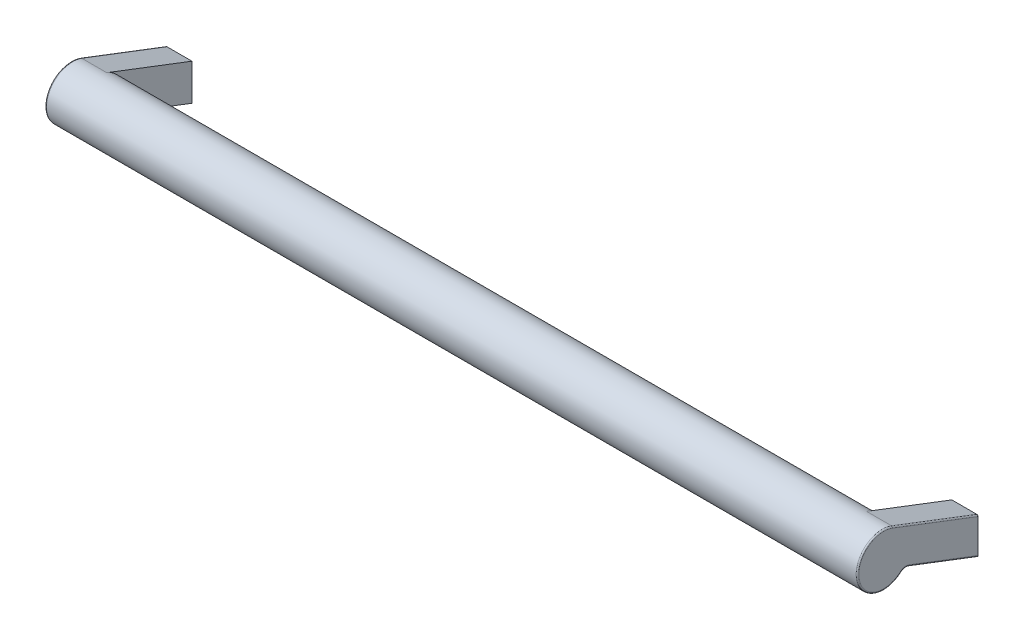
ISO-10303-21;
HEADER;
FILE_DESCRIPTION(('STEP AP214'),'2;1');
FILE_NAME('part.step','',(''),(''),'','','');
FILE_SCHEMA(('AUTOMOTIVE_DESIGN { 1 0 10303 214 1 1 1 1 }'));
ENDSEC;
DATA;
#1=APPLICATION_CONTEXT('core data for automotive mechanical design processes');
#2=APPLICATION_PROTOCOL_DEFINITION('international standard','automotive_design',2000,#1);
#3=PRODUCT_CONTEXT('',#1,'mechanical');
#4=PRODUCT('Part','Part','',(#3));
#5=PRODUCT_RELATED_PRODUCT_CATEGORY('part','',(#4));
#6=PRODUCT_DEFINITION_FORMATION('','',#4);
#7=PRODUCT_DEFINITION_CONTEXT('part definition',#1,'design');
#8=PRODUCT_DEFINITION('design','',#6,#7);
#9=PRODUCT_DEFINITION_SHAPE('','',#8);
#10=(LENGTH_UNIT() NAMED_UNIT(*) SI_UNIT(.MILLI.,.METRE.));
#11=(NAMED_UNIT(*) PLANE_ANGLE_UNIT() SI_UNIT($,.RADIAN.));
#12=(NAMED_UNIT(*) SI_UNIT($,.STERADIAN.) SOLID_ANGLE_UNIT());
#13=UNCERTAINTY_MEASURE_WITH_UNIT(LENGTH_MEASURE(1.E-05),#10,'distance_accuracy_value','');
#14=(GEOMETRIC_REPRESENTATION_CONTEXT(3) GLOBAL_UNCERTAINTY_ASSIGNED_CONTEXT((#13)) GLOBAL_UNIT_ASSIGNED_CONTEXT((#10,
#11,#12)) REPRESENTATION_CONTEXT('',''));
#15=CARTESIAN_POINT('',(0.,0.,0.));
#16=DIRECTION('',(0.,0.,1.));
#17=DIRECTION('',(1.,0.,0.));
#18=AXIS2_PLACEMENT_3D('',#15,#16,#17);
#19=CARTESIAN_POINT('',(145.,10.,36.));
#20=DIRECTION('',(1.,0.,0.));
#21=DIRECTION('',(0.,1.,0.));
#22=AXIS2_PLACEMENT_3D('',#19,#20,#21);
#23=CYLINDRICAL_SURFACE('',#22,10.);
#24=CARTESIAN_POINT('',(5.,10.,36.));
#25=DIRECTION('',(1.,0.,0.));
#26=DIRECTION('',(0.,1.,0.));
#27=AXIS2_PLACEMENT_3D('',#24,#25,#26);
#28=CIRCLE('',#27,10.);
#29=CARTESIAN_POINT('',(5.,2.30325569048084,29.6156341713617));
#30=VERTEX_POINT('',#29);
#31=CARTESIAN_POINT('',(5.,2.72629051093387,29.137555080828));
#32=VERTEX_POINT('',#31);
#33=EDGE_CURVE('E311',#30,#32,#28,.T.);
#34=ORIENTED_EDGE('',*,*,#33,.T.);
#35=CARTESIAN_POINT('',(5.,19.2986703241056,32.3210422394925));
#36=VERTEX_POINT('',#35);
#37=EDGE_CURVE('E38',#32,#36,#28,.T.);
#38=ORIENTED_EDGE('',*,*,#37,.T.);
#39=CARTESIAN_POINT('',(4.99999999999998,10.,36.));
#40=DIRECTION('',(1.,0.,0.));
#41=DIRECTION('',(0.,0.92986703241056,-0.367895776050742));
#42=AXIS2_PLACEMENT_3D('',#39,#40,#41);
#43=CIRCLE('',#42,10.);
#44=CARTESIAN_POINT('',(5.,19.3773951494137,32.5266068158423));
#45=VERTEX_POINT('',#44);
#46=EDGE_CURVE('E24',#36,#45,#43,.T.);
#47=ORIENTED_EDGE('',*,*,#46,.T.);
#48=DIRECTION('',(1.,0.,0.));
#49=VECTOR('',#48,1.);
#50=CARTESIAN_POINT('',(-5.,19.3773951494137,32.5266068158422));
#51=LINE('',#50,#49);
#52=CARTESIAN_POINT('',(-4.5,19.3773951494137,32.5266068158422));
#53=VERTEX_POINT('',#52);
#54=EDGE_CURVE('E463',#45,#53,#51,.F.);
#55=ORIENTED_EDGE('',*,*,#54,.T.);
#56=CARTESIAN_POINT('',(-4.5,10.,36.));
#57=DIRECTION('',(1.,0.,0.));
#58=DIRECTION('',(0.,1.,0.));
#59=AXIS2_PLACEMENT_3D('',#56,#57,#58);
#60=CIRCLE('',#59,10.);
#61=CARTESIAN_POINT('',(-4.5,2.30325569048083,29.6156341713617));
#62=VERTEX_POINT('',#61);
#63=EDGE_CURVE('E393',#62,#53,#60,.F.);
#64=ORIENTED_EDGE('',*,*,#63,.F.);
#65=DIRECTION('',(1.,0.,0.));
#66=VECTOR('',#65,1.);
#67=CARTESIAN_POINT('',(-5.,2.30325569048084,29.6156341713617));
#68=LINE('',#67,#66);
#69=EDGE_CURVE('E454',#62,#30,#68,.T.);
#70=ORIENTED_EDGE('',*,*,#69,.T.);
#71=EDGE_LOOP('',(#34,#38,#47,#55,#64,#70));
#72=FACE_BOUND('',#71,.T.);
#73=DIRECTION('',(1.,0.,0.));
#74=VECTOR('',#73,1.);
#75=CARTESIAN_POINT('',(295.,2.30325569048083,29.6156341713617));
#76=LINE('',#75,#74);
#77=CARTESIAN_POINT('',(295.,2.30325569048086,29.6156341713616));
#78=VERTEX_POINT('',#77);
#79=CARTESIAN_POINT('',(304.5,2.30325569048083,29.6156341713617));
#80=VERTEX_POINT('',#79);
#81=EDGE_CURVE('E198',#78,#80,#76,.T.);
#82=ORIENTED_EDGE('',*,*,#81,.T.);
#83=CARTESIAN_POINT('',(304.5,10.,36.));
#84=DIRECTION('',(1.,0.,0.));
#85=DIRECTION('',(0.,1.,0.));
#86=AXIS2_PLACEMENT_3D('',#83,#84,#85);
#87=CIRCLE('',#86,10.);
#88=CARTESIAN_POINT('',(304.5,19.3773951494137,32.5266068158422));
#89=VERTEX_POINT('',#88);
#90=EDGE_CURVE('E594',#89,#80,#87,.T.);
#91=ORIENTED_EDGE('',*,*,#90,.F.);
#92=DIRECTION('',(1.,0.,0.));
#93=VECTOR('',#92,1.);
#94=CARTESIAN_POINT('',(295.,19.3773951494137,32.5266068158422));
#95=LINE('',#94,#93);
#96=CARTESIAN_POINT('',(295.,19.3773951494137,32.5266068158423));
#97=VERTEX_POINT('',#96);
#98=EDGE_CURVE('E160',#89,#97,#95,.F.);
#99=ORIENTED_EDGE('',*,*,#98,.T.);
#100=CARTESIAN_POINT('',(295.,10.,36.));
#101=DIRECTION('',(-1.,0.,0.));
#102=DIRECTION('',(0.,0.937739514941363,-0.347339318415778));
#103=AXIS2_PLACEMENT_3D('',#100,#101,#102);
#104=CIRCLE('',#103,10.);
#105=CARTESIAN_POINT('',(295.,19.2986703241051,32.3210422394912));
#106=VERTEX_POINT('',#105);
#107=EDGE_CURVE('E154',#97,#106,#104,.T.);
#108=ORIENTED_EDGE('',*,*,#107,.T.);
#109=CARTESIAN_POINT('',(295.,10.,36.));
#110=DIRECTION('',(1.,0.,0.));
#111=DIRECTION('',(0.,1.,0.));
#112=AXIS2_PLACEMENT_3D('',#109,#110,#111);
#113=CIRCLE('',#112,10.);
#114=CARTESIAN_POINT('',(295.,2.72629051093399,29.1375550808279));
#115=VERTEX_POINT('',#114);
#116=EDGE_CURVE('E157',#115,#106,#113,.T.);
#117=ORIENTED_EDGE('',*,*,#116,.F.);
#118=CARTESIAN_POINT('',(295.,10.,36.));
#119=DIRECTION('',(1.,0.,0.));
#120=DIRECTION('',(0.,1.,0.));
#121=AXIS2_PLACEMENT_3D('',#118,#119,#120);
#122=CIRCLE('',#121,10.);
#123=EDGE_CURVE('E572',#115,#78,#122,.F.);
#124=ORIENTED_EDGE('',*,*,#123,.T.);
#125=EDGE_LOOP('',(#82,#91,#99,#108,#117,#124));
#126=FACE_BOUND('',#125,.T.);
#127=ADVANCED_FACE('F14',(#72,#126),#23,.T.);
#128=CARTESIAN_POINT('',(0.,0.,6.));
#129=DIRECTION('',(0.,0.,-1.));
#130=DIRECTION('',(1.,0.,0.));
#131=AXIS2_PLACEMENT_3D('',#128,#129,#130);
#132=PLANE('',#131);
#133=CARTESIAN_POINT('',(0.,0.,6.));
#134=DIRECTION('',(0.,0.,-1.));
#135=DIRECTION('',(1.,0.,0.));
#136=AXIS2_PLACEMENT_3D('',#133,#134,#135);
#137=CIRCLE('',#136,2.);
#138=CARTESIAN_POINT('',(2.,0.,6.));
#139=VERTEX_POINT('',#138);
#140=EDGE_CURVE('E550',#139,#139,#137,.T.);
#141=ORIENTED_EDGE('',*,*,#140,.T.);
#142=EDGE_LOOP('',(#141));
#143=FACE_BOUND('',#142,.T.);
#144=ADVANCED_FACE('F273',(#143),#132,.T.);
#145=CARTESIAN_POINT('',(-5.,0.280812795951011,27.3998443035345));
#146=DIRECTION('',(1.,0.,0.));
#147=DIRECTION('',(0.,1.,0.));
#148=AXIS2_PLACEMENT_3D('',#145,#146,#147);
#149=PLANE('',#148);
#150=CARTESIAN_POINT('',(-5.,10.,36.));
#151=DIRECTION('',(1.,0.,0.));
#152=DIRECTION('',(0.,1.,0.));
#153=AXIS2_PLACEMENT_3D('',#150,#151,#152);
#154=CIRCLE('',#153,9.5);
#155=CARTESIAN_POINT('',(-5.,19.5,36.));
#156=VERTEX_POINT('',#155);
#157=CARTESIAN_POINT('',(-5.,0.500000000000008,36.));
#158=VERTEX_POINT('',#157);
#159=EDGE_CURVE('E328',#156,#158,#154,.T.);
#160=ORIENTED_EDGE('',*,*,#159,.F.);
#161=CARTESIAN_POINT('',(-5.,10.,36.));
#162=DIRECTION('',(1.,0.,0.));
#163=DIRECTION('',(0.,0.937838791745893,-0.347071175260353));
#164=AXIS2_PLACEMENT_3D('',#161,#162,#163);
#165=CIRCLE('',#164,9.49999999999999);
#166=CARTESIAN_POINT('',(-5.,18.909468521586,32.7028238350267));
#167=VERTEX_POINT('',#166);
#168=EDGE_CURVE('E333',#167,#156,#165,.T.);
#169=ORIENTED_EDGE('',*,*,#168,.F.);
#170=DIRECTION('',(0.,0.357639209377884,0.933859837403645));
#171=VECTOR('',#170,1.);
#172=CARTESIAN_POINT('',(-5.,6.38530633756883,0.));
#173=LINE('',#172,#171);
#174=CARTESIAN_POINT('',(-5.,6.38530633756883,0.));
#175=VERTEX_POINT('',#174);
#176=EDGE_CURVE('E336',#175,#167,#173,.T.);
#177=ORIENTED_EDGE('',*,*,#176,.F.);
#178=DIRECTION('',(0.,1.,0.));
#179=VECTOR('',#178,1.);
#180=CARTESIAN_POINT('',(-5.,0.280812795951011,0.));
#181=LINE('',#180,#179);
#182=CARTESIAN_POINT('',(-5.,-6.46458774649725,0.));
#183=VERTEX_POINT('',#182);
#184=EDGE_CURVE('E340',#183,#175,#181,.T.);
#185=ORIENTED_EDGE('',*,*,#184,.F.);
#186=DIRECTION('',(0.,-0.357639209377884,-0.933859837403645));
#187=VECTOR('',#186,1.);
#188=CARTESIAN_POINT('',(-5.,3.54932222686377,26.1481070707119));
#189=LINE('',#188,#187);
#190=CARTESIAN_POINT('',(-5.,3.54932222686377,26.1481070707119));
#191=VERTEX_POINT('',#190);
#192=EDGE_CURVE('E346',#191,#183,#189,.T.);
#193=ORIENTED_EDGE('',*,*,#192,.F.);
#194=CARTESIAN_POINT('',(-5.,0.280812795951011,27.3998443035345));
#195=DIRECTION('',(-1.,0.,0.));
#196=DIRECTION('',(0.,1.,0.));
#197=AXIS2_PLACEMENT_3D('',#194,#195,#196);
#198=CIRCLE('',#197,3.5);
#199=CARTESIAN_POINT('',(-5.,3.78081279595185,27.3998443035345));
#200=VERTEX_POINT('',#199);
#201=EDGE_CURVE('E358',#200,#191,#198,.T.);
#202=ORIENTED_EDGE('',*,*,#201,.F.);
#203=CARTESIAN_POINT('',(-5.,0.280812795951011,27.3998443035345));
#204=DIRECTION('',(-1.,0.,0.));
#205=DIRECTION('',(0.,0.681805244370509,0.731533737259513));
#206=AXIS2_PLACEMENT_3D('',#203,#204,#205);
#207=CIRCLE('',#206,3.50000000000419);
#208=CARTESIAN_POINT('',(-5.,2.66713115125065,29.9602123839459));
#209=VERTEX_POINT('',#208);
#210=EDGE_CURVE('E400',#209,#200,#207,.T.);
#211=ORIENTED_EDGE('',*,*,#210,.F.);
#212=CARTESIAN_POINT('',(-5.,10.,36.));
#213=DIRECTION('',(1.,0.,0.));
#214=DIRECTION('',(0.,-1.,0.));
#215=AXIS2_PLACEMENT_3D('',#212,#213,#214);
#216=CIRCLE('',#215,9.5);
#217=EDGE_CURVE('E319',#158,#209,#216,.T.);
#218=ORIENTED_EDGE('',*,*,#217,.F.);
#219=EDGE_LOOP('',(#160,#169,#177,#185,#193,#202,#211,#218));
#220=FACE_BOUND('',#219,.T.);
#221=ADVANCED_FACE('F276',(#220),#149,.F.);
#222=CARTESIAN_POINT('',(0.,0.,6.));
#223=DIRECTION('',(0.,0.,-1.));
#224=DIRECTION('',(1.,0.,0.));
#225=AXIS2_PLACEMENT_3D('',#222,#223,#224);
#226=CYLINDRICAL_SURFACE('',#225,2.);
#227=ORIENTED_EDGE('',*,*,#140,.F.);
#228=EDGE_LOOP('',(#227));
#229=FACE_BOUND('',#228,.T.);
#230=CARTESIAN_POINT('',(0.,0.,0.));
#231=DIRECTION('',(0.,0.,-1.));
#232=DIRECTION('',(1.,0.,0.));
#233=AXIS2_PLACEMENT_3D('',#230,#231,#232);
#234=CIRCLE('',#233,2.);
#235=CARTESIAN_POINT('',(2.,0.,0.));
#236=VERTEX_POINT('',#235);
#237=EDGE_CURVE('E569',#236,#236,#234,.T.);
#238=ORIENTED_EDGE('',*,*,#237,.T.);
#239=EDGE_LOOP('',(#238));
#240=FACE_BOUND('',#239,.T.);
#241=ADVANCED_FACE('F278',(#229,#240),#226,.F.);
#242=CARTESIAN_POINT('',(-4.5,3.54932222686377,26.1481070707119));
#243=DIRECTION('',(0.,0.357639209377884,0.933859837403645));
#244=DIRECTION('',(0.,0.933859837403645,-0.357639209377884));
#245=AXIS2_PLACEMENT_3D('',#242,#243,#244);
#246=CYLINDRICAL_SURFACE('',#245,0.5);
#247=CARTESIAN_POINT('',(-4.5,3.54932222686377,26.1481070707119));
#248=DIRECTION('',(0.,0.357639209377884,0.933859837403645));
#249=DIRECTION('',(0.,0.933859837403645,-0.357639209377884));
#250=AXIS2_PLACEMENT_3D('',#247,#248,#249);
#251=CIRCLE('',#250,0.5);
#252=CARTESIAN_POINT('',(-4.5,3.08239230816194,26.3269266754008));
#253=VERTEX_POINT('',#252);
#254=EDGE_CURVE('E515',#253,#191,#251,.F.);
#255=ORIENTED_EDGE('',*,*,#254,.T.);
#256=ORIENTED_EDGE('',*,*,#192,.T.);
#257=CARTESIAN_POINT('',(-4.5,-6.46458774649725,0.));
#258=DIRECTION('',(0.,0.,1.));
#259=DIRECTION('',(0.,1.,0.));
#260=AXIS2_PLACEMENT_3D('',#257,#258,#259);
#261=ELLIPSE('',#260,0.535412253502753,0.5);
#262=CARTESIAN_POINT('',(-4.5,-7.,0.));
#263=VERTEX_POINT('',#262);
#264=EDGE_CURVE('E467',#183,#263,#261,.T.);
#265=ORIENTED_EDGE('',*,*,#264,.T.);
#266=DIRECTION('',(0.,0.357639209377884,0.933859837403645));
#267=VECTOR('',#266,1.);
#268=CARTESIAN_POINT('',(-4.5,3.08239230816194,26.3269266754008));
#269=LINE('',#268,#267);
#270=EDGE_CURVE('E560',#263,#253,#269,.T.);
#271=ORIENTED_EDGE('',*,*,#270,.T.);
#272=EDGE_LOOP('',(#255,#256,#265,#271));
#273=FACE_BOUND('',#272,.T.);
#274=ADVANCED_FACE('F281',(#273),#246,.T.);
#275=CARTESIAN_POINT('',(-4.5,0.280812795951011,27.3998443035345));
#276=DIRECTION('',(1.,0.,0.));
#277=DIRECTION('',(0.,1.,0.));
#278=AXIS2_PLACEMENT_3D('',#275,#276,#277);
#279=TOROIDAL_SURFACE('',#278,3.5,0.5);
#280=ORIENTED_EDGE('',*,*,#201,.T.);
#281=ORIENTED_EDGE('',*,*,#254,.F.);
#282=CARTESIAN_POINT('',(-4.5,0.280812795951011,27.3998443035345));
#283=DIRECTION('',(1.,0.,0.));
#284=DIRECTION('',(0.,1.,0.));
#285=AXIS2_PLACEMENT_3D('',#282,#283,#284);
#286=CIRCLE('',#285,3.);
#287=EDGE_CURVE('E528',#253,#62,#286,.T.);
#288=ORIENTED_EDGE('',*,*,#287,.T.);
#289=CARTESIAN_POINT('',(-5.,2.66713115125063,29.9602123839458));
#290=CARTESIAN_POINT('',(-5.00000003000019,2.66325531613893,29.956566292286));
#291=CARTESIAN_POINT('',(-4.99991542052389,2.65937931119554,29.9529203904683));
#292=CARTESIAN_POINT('',(-4.99957964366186,2.65168852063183,29.9456865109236));
#293=CARTESIAN_POINT('',(-4.99933096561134,2.64787367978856,29.9420984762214));
#294=CARTESIAN_POINT('',(-4.99867470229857,2.64030893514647,29.9349834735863));
#295=CARTESIAN_POINT('',(-4.99826956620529,2.63655891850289,29.9314563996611));
#296=CARTESIAN_POINT('',(-4.99730810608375,2.62912719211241,29.9244661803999));
#297=CARTESIAN_POINT('',(-4.99675418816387,2.62544531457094,29.9210028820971));
#298=CARTESIAN_POINT('',(-4.99550284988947,2.61815283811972,29.9141427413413));
#299=CARTESIAN_POINT('',(-4.99480779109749,2.61454202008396,29.9107457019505));
#300=CARTESIAN_POINT('',(-4.99328190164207,2.60739448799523,29.9040205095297));
#301=CARTESIAN_POINT('',(-4.9924533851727,2.60385750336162,29.9006921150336));
#302=CARTESIAN_POINT('',(-4.98979715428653,2.59344591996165,29.8908929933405));
#303=CARTESIAN_POINT('',(-4.98776893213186,2.58659856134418,29.8844464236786));
#304=CARTESIAN_POINT('',(-4.98325124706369,2.57322647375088,29.8718515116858));
#305=CARTESIAN_POINT('',(-4.98077911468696,2.56669853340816,29.8657003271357));
#306=CARTESIAN_POINT('',(-4.97543268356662,2.55397558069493,29.8537052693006));
#307=CARTESIAN_POINT('',(-4.97257488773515,2.54777678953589,29.8478580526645));
#308=CARTESIAN_POINT('',(-4.96651445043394,2.53571898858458,29.8364772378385));
#309=CARTESIAN_POINT('',(-4.96332745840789,2.52985569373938,29.8309398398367));
#310=CARTESIAN_POINT('',(-4.95666365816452,2.51847178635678,29.8201816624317));
#311=CARTESIAN_POINT('',(-4.95320163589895,2.51294647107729,29.8149566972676));
#312=CARTESIAN_POINT('',(-4.94604029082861,2.50223812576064,29.8048236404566));
#313=CARTESIAN_POINT('',(-4.94235488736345,2.49705005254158,29.7999110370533));
#314=CARTESIAN_POINT('',(-4.93479656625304,2.4870128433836,29.7904004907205));
#315=CARTESIAN_POINT('',(-4.93093670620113,2.48215839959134,29.7857977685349));
#316=CARTESIAN_POINT('',(-4.92307639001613,2.47278256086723,29.7769026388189));
#317=CARTESIAN_POINT('',(-4.91908814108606,2.46825566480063,29.7726052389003));
#318=CARTESIAN_POINT('',(-4.91101501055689,2.45952686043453,29.7643145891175));
#319=CARTESIAN_POINT('',(-4.90694150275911,2.45531932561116,29.7603161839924));
#320=CARTESIAN_POINT('',(-4.89873881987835,2.44721938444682,29.7526158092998));
#321=CARTESIAN_POINT('',(-4.89462020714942,2.44332128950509,29.7489085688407));
#322=CARTESIAN_POINT('',(-4.88636530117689,2.43582884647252,29.741781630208));
#323=CARTESIAN_POINT('',(-4.88223878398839,2.43222880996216,29.7383565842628));
#324=CARTESIAN_POINT('',(-4.87400305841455,2.42532009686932,29.7317838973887));
#325=CARTESIAN_POINT('',(-4.86990287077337,2.42200578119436,29.7286308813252));
#326=CARTESIAN_POINT('',(-4.8617520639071,2.41565469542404,29.7225922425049));
#327=CARTESIAN_POINT('',(-4.85770973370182,2.41261241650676,29.7197012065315));
#328=CARTESIAN_POINT('',(-4.84750942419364,2.40519799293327,29.7126579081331));
#329=CARTESIAN_POINT('',(-4.84126564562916,2.40088697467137,29.7085649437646));
#330=CARTESIAN_POINT('',(-4.82852259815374,2.39253353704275,29.700632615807));
#331=CARTESIAN_POINT('',(-4.82202532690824,2.38848950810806,29.6967917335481));
#332=CARTESIAN_POINT('',(-4.80879791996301,2.38067518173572,29.6893695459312));
#333=CARTESIAN_POINT('',(-4.80206965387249,2.37690321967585,29.6857866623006));
#334=CARTESIAN_POINT('',(-4.78840324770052,2.36963825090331,29.6788847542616));
#335=CARTESIAN_POINT('',(-4.78146684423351,2.36614352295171,29.6755641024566));
#336=CARTESIAN_POINT('',(-4.76740696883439,2.35943688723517,29.6691902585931));
#337=CARTESIAN_POINT('',(-4.76028509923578,2.35622320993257,29.6661353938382));
#338=CARTESIAN_POINT('',(-4.74587696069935,2.35008160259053,29.660295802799));
#339=CARTESIAN_POINT('',(-4.73859215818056,2.34715186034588,29.6575093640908));
#340=CARTESIAN_POINT('',(-4.72388058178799,2.34158004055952,29.6522084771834));
#341=CARTESIAN_POINT('',(-4.71645513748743,2.3389361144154,29.6496922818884));
#342=CARTESIAN_POINT('',(-4.7014844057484,2.33393689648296,29.6449329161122));
#343=CARTESIAN_POINT('',(-4.69394031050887,2.33157972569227,29.6426879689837));
#344=CARTESIAN_POINT('',(-4.67875404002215,2.32715406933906,29.6384713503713));
#345=CARTESIAN_POINT('',(-4.67111291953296,2.32508368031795,29.6364978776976));
#346=CARTESIAN_POINT('',(-4.65575393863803,2.32123075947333,29.6328237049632));
#347=CARTESIAN_POINT('',(-4.6480369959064,2.31944630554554,29.631121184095));
#348=CARTESIAN_POINT('',(-4.63254723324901,2.31616358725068,29.6279876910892));
#349=CARTESIAN_POINT('',(-4.62477519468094,2.31466338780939,29.6265548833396));
#350=CARTESIAN_POINT('',(-4.60919557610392,2.31194671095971,29.6239589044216));
#351=CARTESIAN_POINT('',(-4.60138864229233,2.31072829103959,29.6227938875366));
#352=CARTESIAN_POINT('',(-4.5857589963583,2.30857195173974,29.6207309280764));
#353=CARTESIAN_POINT('',(-4.57793679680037,2.30763208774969,29.6198311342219));
#354=CARTESIAN_POINT('',(-4.56229576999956,2.30602891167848,29.6182954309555));
#355=CARTESIAN_POINT('',(-4.55447732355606,2.30536365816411,29.6176576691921));
#356=CARTESIAN_POINT('',(-4.53886230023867,2.30430512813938,29.6166422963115));
#357=CARTESIAN_POINT('',(-4.53106597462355,2.30390991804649,29.6162628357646));
#358=CARTESIAN_POINT('',(-4.51551301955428,2.30338610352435,29.6157596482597));
#359=CARTESIAN_POINT('',(-4.50775651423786,2.30325557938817,29.6156340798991));
#360=CARTESIAN_POINT('',(-4.5,2.30325569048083,29.6156341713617));
#361=B_SPLINE_CURVE_WITH_KNOTS('',3,(#289,#290,#291,#292,#293,#294,#295,#296,#297,#298,#299,
#300,#301,#302,#303,#304,#305,#306,#307,#308,#309,#310,#311,#312,#313,#314,#315,#316,#317,#318,
#319,#320,#321,#322,#323,#324,#325,#326,#327,#328,#329,#330,#331,#332,#333,#334,#335,#336,#337,
#338,#339,#340,#341,#342,#343,#344,#345,#346,#347,#348,#349,#350,#351,#352,#353,#354,#355,#356,
#357,#358,#359,#360),.UNSPECIFIED.,.F.,.F.,(4,2,2,2,2,2,2,2,2,2,2,2,2,2,2,2,2,2,2,2,2,2,2,2,2,2,
2,2,2,2,2,2,2,2,2,4),(0.,0.015963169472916,0.0316895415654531,0.0471791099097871,
0.0624318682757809,0.0774478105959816,0.0922269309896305,0.12107170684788,0.148969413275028,
0.175919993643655,0.201923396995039,0.226979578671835,0.251088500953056,0.274250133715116,
0.296464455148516,0.317731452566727,0.338051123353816,0.357423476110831,0.375848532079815,
0.393326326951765,0.419177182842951,0.444854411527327,0.470358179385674,0.495688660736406,
0.520846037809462,0.54583050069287,0.570642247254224,0.595281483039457,0.619748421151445,
0.644043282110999,0.668166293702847,0.692117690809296,0.715897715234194,0.739506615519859,
0.762944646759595,0.786212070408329),.UNSPECIFIED.);
#362=EDGE_CURVE('E388',#209,#62,#361,.T.);
#363=ORIENTED_EDGE('',*,*,#362,.F.);
#364=ORIENTED_EDGE('',*,*,#210,.T.);
#365=EDGE_LOOP('',(#280,#281,#288,#363,#364));
#366=FACE_BOUND('',#365,.T.);
#367=ADVANCED_FACE('F301',(#366),#279,.T.);
#368=CARTESIAN_POINT('',(-4.5,10.,36.));
#369=DIRECTION('',(1.,0.,0.));
#370=DIRECTION('',(0.,1.,0.));
#371=AXIS2_PLACEMENT_3D('',#368,#369,#370);
#372=TOROIDAL_SURFACE('',#371,9.5,0.5);
#373=ORIENTED_EDGE('',*,*,#362,.T.);
#374=ORIENTED_EDGE('',*,*,#63,.T.);
#375=CARTESIAN_POINT('',(-4.5,19.3773951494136,32.5266068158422));
#376=CARTESIAN_POINT('',(-4.50818123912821,19.3774056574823,32.5266346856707));
#377=CARTESIAN_POINT('',(-4.5163624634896,19.3772275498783,32.526732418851));
#378=CARTESIAN_POINT('',(-4.53270521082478,19.3764952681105,32.5270671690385));
#379=CARTESIAN_POINT('',(-4.54086673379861,19.3759410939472,32.5273041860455));
#380=CARTESIAN_POINT('',(-4.557150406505,19.3744578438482,32.5279170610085));
#381=CARTESIAN_POINT('',(-4.56527255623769,19.3735287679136,32.5282929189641));
#382=CARTESIAN_POINT('',(-4.58145791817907,19.3712980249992,32.5291826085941));
#383=CARTESIAN_POINT('',(-4.58952113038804,19.3699963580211,32.5296964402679));
#384=CARTESIAN_POINT('',(-4.60556919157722,19.3670235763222,32.530860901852));
#385=CARTESIAN_POINT('',(-4.61355404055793,19.3653524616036,32.5315115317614));
#386=CARTESIAN_POINT('',(-4.62942613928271,19.361644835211,32.532948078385));
#387=CARTESIAN_POINT('',(-4.63731338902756,19.3596083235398,32.5337339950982));
#388=CARTESIAN_POINT('',(-4.65297128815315,19.3551748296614,32.5354392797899));
#389=CARTESIAN_POINT('',(-4.66074193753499,19.3527778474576,32.5363586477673));
#390=CARTESIAN_POINT('',(-4.67614791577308,19.3476292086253,32.5383286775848));
#391=CARTESIAN_POINT('',(-4.68378324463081,19.3448775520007,32.5393793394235));
#392=CARTESIAN_POINT('',(-4.69890018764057,19.3390262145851,32.5416094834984));
#393=CARTESIAN_POINT('',(-4.70638180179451,19.3359265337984,32.542788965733));
#394=CARTESIAN_POINT('',(-4.72117329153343,19.3293866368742,32.5452739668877));
#395=CARTESIAN_POINT('',(-4.72848316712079,19.3259464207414,32.5465794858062));
#396=CARTESIAN_POINT('',(-4.74291356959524,19.3187337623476,32.5493134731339));
#397=CARTESIAN_POINT('',(-4.75003409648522,19.3149613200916,32.5507419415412));
#398=CARTESIAN_POINT('',(-4.7640686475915,19.3070933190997,32.5537184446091));
#399=CARTESIAN_POINT('',(-4.77098267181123,19.3029977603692,32.5552664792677));
#400=CARTESIAN_POINT('',(-4.7845875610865,19.294493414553,32.5584784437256));
#401=CARTESIAN_POINT('',(-4.79127842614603,19.2900846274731,32.5601423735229));
#402=CARTESIAN_POINT('',(-4.80442087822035,19.2809644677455,32.5635821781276));
#403=CARTESIAN_POINT('',(-4.81087246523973,19.2762530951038,32.5653580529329));
#404=CARTESIAN_POINT('',(-4.82352081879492,19.2665391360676,32.5690175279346));
#405=CARTESIAN_POINT('',(-4.82971758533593,19.2615365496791,32.570901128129));
#406=CARTESIAN_POINT('',(-4.84184136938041,19.251252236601,32.5747715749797));
#407=CARTESIAN_POINT('',(-4.84776838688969,19.2459705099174,32.5767584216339));
#408=CARTESIAN_POINT('',(-4.85933839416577,19.2351406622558,32.5808306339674));
#409=CARTESIAN_POINT('',(-4.864981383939,19.2295925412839,32.5829159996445));
#410=CARTESIAN_POINT('',(-4.87596974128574,19.2182432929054,32.5871802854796));
#411=CARTESIAN_POINT('',(-4.88131510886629,19.212442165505,32.5893592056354));
#412=CARTESIAN_POINT('',(-4.89169534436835,19.2006009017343,32.5938054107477));
#413=CARTESIAN_POINT('',(-4.89673021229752,19.1945607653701,32.5960726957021));
#414=CARTESIAN_POINT('',(-4.90647731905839,19.1822560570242,32.6006902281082));
#415=CARTESIAN_POINT('',(-4.91118955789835,19.1759914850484,32.6030404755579));
#416=CARTESIAN_POINT('',(-4.92028005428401,19.1632530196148,32.6078183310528));
#417=CARTESIAN_POINT('',(-4.92465831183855,19.1567791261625,32.6102459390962));
#418=CARTESIAN_POINT('',(-4.93307029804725,19.1436376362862,32.615172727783));
#419=CARTESIAN_POINT('',(-4.93710402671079,19.1369700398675,32.6176719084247));
#420=CARTESIAN_POINT('',(-4.94481723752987,19.1234572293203,32.6227358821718));
#421=CARTESIAN_POINT('',(-4.9484967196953,19.1166120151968,32.6253006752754));
#422=CARTESIAN_POINT('',(-4.95549257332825,19.1027604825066,32.630489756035));
#423=CARTESIAN_POINT('',(-4.95880894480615,19.0957541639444,32.6331140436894));
#424=CARTESIAN_POINT('',(-4.96507058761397,19.0815973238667,32.6384158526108));
#425=CARTESIAN_POINT('',(-4.9680158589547,19.0744468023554,32.6410933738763));
#426=CARTESIAN_POINT('',(-4.97352820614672,19.0600188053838,32.6464952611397));
#427=CARTESIAN_POINT('',(-4.97609528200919,19.0527413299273,32.6492196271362));
#428=CARTESIAN_POINT('',(-4.98084505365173,19.038076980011,32.6547087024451));
#429=CARTESIAN_POINT('',(-4.98302774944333,19.0306901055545,32.6574734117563));
#430=CARTESIAN_POINT('',(-4.98700350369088,19.015824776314,32.6630365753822));
#431=CARTESIAN_POINT('',(-4.98879656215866,19.0083463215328,32.6658350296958));
#432=CARTESIAN_POINT('',(-4.99198871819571,18.9933158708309,32.6714590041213));
#433=CARTESIAN_POINT('',(-4.99338781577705,18.9857638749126,32.6742845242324));
#434=CARTESIAN_POINT('',(-4.99578869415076,18.9706045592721,32.6799558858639));
#435=CARTESIAN_POINT('',(-4.99679047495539,18.9629972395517,32.6828017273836));
#436=CARTESIAN_POINT('',(-4.99839425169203,18.9477456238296,32.6885069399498));
#437=CARTESIAN_POINT('',(-4.9989962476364,18.9401013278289,32.6913663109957));
#438=CARTESIAN_POINT('',(-4.99979920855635,18.9247942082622,32.6970917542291));
#439=CARTESIAN_POINT('',(-5.00000017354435,18.9171313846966,32.6999578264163));
#440=CARTESIAN_POINT('',(-5.,18.909468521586,32.7028238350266));
#441=B_SPLINE_CURVE_WITH_KNOTS('',3,(#375,#376,#377,#378,#379,#380,#381,#382,#383,#384,#385,
#386,#387,#388,#389,#390,#391,#392,#393,#394,#395,#396,#397,#398,#399,#400,#401,#402,#403,#404,
#405,#406,#407,#408,#409,#410,#411,#412,#413,#414,#415,#416,#417,#418,#419,#420,#421,#422,#423,
#424,#425,#426,#427,#428,#429,#430,#431,#432,#433,#434,#435,#436,#437,#438,#439,#440),
.UNSPECIFIED.,.F.,.F.,(4,2,2,2,2,2,2,2,2,2,2,2,2,2,2,2,2,2,2,2,2,2,2,2,2,2,2,2,2,2,2,2,4),(0.,
0.0245413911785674,0.0490827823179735,0.0736241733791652,0.0981655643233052,0.122706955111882,
0.147248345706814,0.171789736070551,0.196331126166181,0.220872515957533,0.245413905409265,
0.26995529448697,0.294496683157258,0.319038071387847,0.343579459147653,0.368120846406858,
0.392662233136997,0.417203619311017,0.441745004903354,0.466286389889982,0.490827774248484,
0.515369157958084,0.539910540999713,0.564451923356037,0.588993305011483,0.613534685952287,
0.638076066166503,0.662617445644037,0.68715882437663,0.711700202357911,0.736241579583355,
0.760782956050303,0.785324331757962),.UNSPECIFIED.);
#442=EDGE_CURVE('E479',#53,#167,#441,.T.);
#443=ORIENTED_EDGE('',*,*,#442,.T.);
#444=ORIENTED_EDGE('',*,*,#168,.T.);
#445=ORIENTED_EDGE('',*,*,#159,.T.);
#446=ORIENTED_EDGE('',*,*,#217,.T.);
#447=EDGE_LOOP('',(#373,#374,#443,#444,#445,#446));
#448=FACE_BOUND('',#447,.T.);
#449=ADVANCED_FACE('F365',(#448),#372,.T.);
#450=CARTESIAN_POINT('',(-4.5,14.7556402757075,21.8564365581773));
#451=DIRECTION('',(0.,-0.357639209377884,-0.933859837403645));
#452=DIRECTION('',(0.,-0.933859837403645,0.357639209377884));
#453=AXIS2_PLACEMENT_3D('',#450,#451,#452);
#454=CYLINDRICAL_SURFACE('',#453,0.5);
#455=CARTESIAN_POINT('',(-4.5,6.38530633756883,0.));
#456=DIRECTION('',(0.,0.,1.));
#457=DIRECTION('',(0.,-1.,0.));
#458=AXIS2_PLACEMENT_3D('',#455,#456,#457);
#459=ELLIPSE('',#458,0.535412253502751,0.5);
#460=CARTESIAN_POINT('',(-4.5,6.92071859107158,0.));
#461=VERTEX_POINT('',#460);
#462=EDGE_CURVE('E551',#461,#175,#459,.T.);
#463=ORIENTED_EDGE('',*,*,#462,.T.);
#464=ORIENTED_EDGE('',*,*,#176,.T.);
#465=ORIENTED_EDGE('',*,*,#442,.F.);
#466=DIRECTION('',(0.,-0.357639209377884,-0.933859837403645));
#467=VECTOR('',#466,1.);
#468=CARTESIAN_POINT('',(-4.5,15.2225701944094,21.6776169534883));
#469=LINE('',#468,#467);
#470=EDGE_CURVE('E552',#53,#461,#469,.T.);
#471=ORIENTED_EDGE('',*,*,#470,.T.);
#472=EDGE_LOOP('',(#463,#464,#465,#471));
#473=FACE_BOUND('',#472,.T.);
#474=ADVANCED_FACE('F375',(#473),#454,.T.);
#475=CARTESIAN_POINT('',(-5.,6.92071859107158,0.));
#476=DIRECTION('',(0.,0.,1.));
#477=DIRECTION('',(-1.,0.,0.));
#478=AXIS2_PLACEMENT_3D('',#475,#476,#477);
#479=PLANE('',#478);
#480=ORIENTED_EDGE('',*,*,#237,.F.);
#481=EDGE_LOOP('',(#480));
#482=FACE_BOUND('',#481,.T.);
#483=ORIENTED_EDGE('',*,*,#462,.F.);
#484=DIRECTION('',(-1.,0.,0.));
#485=VECTOR('',#484,1.);
#486=CARTESIAN_POINT('',(-5.,6.92071859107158,0.));
#487=LINE('',#486,#485);
#488=CARTESIAN_POINT('',(5.,6.92071859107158,0.));
#489=VERTEX_POINT('',#488);
#490=EDGE_CURVE('E548',#489,#461,#487,.T.);
#491=ORIENTED_EDGE('',*,*,#490,.F.);
#492=DIRECTION('',(0.,-1.,0.));
#493=VECTOR('',#492,1.);
#494=CARTESIAN_POINT('',(5.,6.92071859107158,0.));
#495=LINE('',#494,#493);
#496=CARTESIAN_POINT('',(5.,-7.,0.));
#497=VERTEX_POINT('',#496);
#498=EDGE_CURVE('E545',#497,#489,#495,.F.);
#499=ORIENTED_EDGE('',*,*,#498,.F.);
#500=DIRECTION('',(-1.,0.,0.));
#501=VECTOR('',#500,1.);
#502=CARTESIAN_POINT('',(-5.,-7.,0.));
#503=LINE('',#502,#501);
#504=EDGE_CURVE('E549',#263,#497,#503,.F.);
#505=ORIENTED_EDGE('',*,*,#504,.F.);
#506=ORIENTED_EDGE('',*,*,#264,.F.);
#507=ORIENTED_EDGE('',*,*,#184,.T.);
#508=EDGE_LOOP('',(#483,#491,#499,#505,#506,#507));
#509=FACE_BOUND('',#508,.T.);
#510=ADVANCED_FACE('F291',(#482,#509),#479,.F.);
#511=CARTESIAN_POINT('',(-5.,-7.,0.));
#512=DIRECTION('',(0.,0.933859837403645,-0.357639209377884));
#513=DIRECTION('',(0.,-0.357639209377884,-0.933859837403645));
#514=AXIS2_PLACEMENT_3D('',#511,#512,#513);
#515=PLANE('',#514);
#516=ORIENTED_EDGE('',*,*,#270,.F.);
#517=ORIENTED_EDGE('',*,*,#504,.T.);
#518=DIRECTION('',(0.,-0.357639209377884,-0.933859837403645));
#519=VECTOR('',#518,1.);
#520=CARTESIAN_POINT('',(5.,3.08239230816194,26.3269266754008));
#521=LINE('',#520,#519);
#522=CARTESIAN_POINT('',(5.,3.08239230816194,26.3269266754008));
#523=VERTEX_POINT('',#522);
#524=EDGE_CURVE('E461',#523,#497,#521,.T.);
#525=ORIENTED_EDGE('',*,*,#524,.F.);
#526=DIRECTION('',(-1.,0.,0.));
#527=VECTOR('',#526,1.);
#528=CARTESIAN_POINT('',(-5.,3.08239230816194,26.3269266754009));
#529=LINE('',#528,#527);
#530=EDGE_CURVE('E458',#253,#523,#529,.F.);
#531=ORIENTED_EDGE('',*,*,#530,.F.);
#532=EDGE_LOOP('',(#516,#517,#525,#531));
#533=FACE_BOUND('',#532,.T.);
#534=ADVANCED_FACE('F287',(#533),#515,.F.);
#535=CARTESIAN_POINT('',(-5.,0.280812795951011,27.3998443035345));
#536=DIRECTION('',(1.,0.,0.));
#537=DIRECTION('',(0.,1.,0.));
#538=AXIS2_PLACEMENT_3D('',#535,#536,#537);
#539=CYLINDRICAL_SURFACE('',#538,3.);
#540=ORIENTED_EDGE('',*,*,#287,.F.);
#541=ORIENTED_EDGE('',*,*,#530,.T.);
#542=CARTESIAN_POINT('',(5.,0.280812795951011,27.3998443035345));
#543=DIRECTION('',(1.,0.,0.));
#544=DIRECTION('',(0.,1.,0.));
#545=AXIS2_PLACEMENT_3D('',#542,#543,#544);
#546=CIRCLE('',#545,3.);
#547=EDGE_CURVE('E26',#32,#523,#546,.F.);
#548=ORIENTED_EDGE('',*,*,#547,.F.);
#549=EDGE_CURVE('E9',#30,#32,#546,.F.);
#550=ORIENTED_EDGE('',*,*,#549,.F.);
#551=ORIENTED_EDGE('',*,*,#69,.F.);
#552=EDGE_LOOP('',(#540,#541,#548,#550,#551));
#553=FACE_BOUND('',#552,.T.);
#554=ADVANCED_FACE('F283',(#553),#539,.F.);
#555=CARTESIAN_POINT('',(-5.,6.92071859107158,0.));
#556=DIRECTION('',(0.,-0.933859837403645,0.357639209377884));
#557=DIRECTION('',(0.,0.357639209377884,0.933859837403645));
#558=AXIS2_PLACEMENT_3D('',#555,#556,#557);
#559=PLANE('',#558);
#560=ORIENTED_EDGE('',*,*,#470,.F.);
#561=ORIENTED_EDGE('',*,*,#54,.F.);
#562=ORIENTED_EDGE('',*,*,#46,.F.);
#563=DIRECTION('',(0.,0.357639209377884,0.933859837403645));
#564=VECTOR('',#563,1.);
#565=CARTESIAN_POINT('',(5.,6.92071859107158,0.));
#566=LINE('',#565,#564);
#567=EDGE_CURVE('E460',#489,#36,#566,.T.);
#568=ORIENTED_EDGE('',*,*,#567,.F.);
#569=ORIENTED_EDGE('',*,*,#490,.T.);
#570=EDGE_LOOP('',(#560,#561,#562,#568,#569));
#571=FACE_BOUND('',#570,.T.);
#572=ADVANCED_FACE('F286',(#571),#559,.F.);
#573=CARTESIAN_POINT('',(5.,0.280812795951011,27.3998443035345));
#574=DIRECTION('',(1.,0.,0.));
#575=DIRECTION('',(0.,1.,0.));
#576=AXIS2_PLACEMENT_3D('',#573,#574,#575);
#577=PLANE('',#576);
#578=ORIENTED_EDGE('',*,*,#567,.T.);
#579=ORIENTED_EDGE('',*,*,#37,.F.);
#580=ORIENTED_EDGE('',*,*,#547,.T.);
#581=ORIENTED_EDGE('',*,*,#524,.T.);
#582=ORIENTED_EDGE('',*,*,#498,.T.);
#583=EDGE_LOOP('',(#578,#579,#580,#581,#582));
#584=FACE_BOUND('',#583,.T.);
#585=ADVANCED_FACE('F293',(#584),#577,.T.);
#586=CARTESIAN_POINT('',(5.,10.,36.));
#587=DIRECTION('',(-1.,0.,0.));
#588=DIRECTION('',(0.,-1.,0.));
#589=AXIS2_PLACEMENT_3D('',#586,#587,#588);
#590=PLANE('',#589);
#591=ORIENTED_EDGE('',*,*,#33,.F.);
#592=ORIENTED_EDGE('',*,*,#549,.T.);
#593=EDGE_LOOP('',(#591,#592));
#594=FACE_BOUND('',#593,.T.);
#595=ADVANCED_FACE('F268',(#594),#590,.T.);
#596=CARTESIAN_POINT('',(300.,0.,6.));
#597=DIRECTION('',(0.,0.,-1.));
#598=DIRECTION('',(1.,0.,0.));
#599=AXIS2_PLACEMENT_3D('',#596,#597,#598);
#600=PLANE('',#599);
#601=CARTESIAN_POINT('',(300.,0.,6.));
#602=DIRECTION('',(0.,0.,-1.));
#603=DIRECTION('',(1.,0.,0.));
#604=AXIS2_PLACEMENT_3D('',#601,#602,#603);
#605=CIRCLE('',#604,2.);
#606=CARTESIAN_POINT('',(302.,0.,6.));
#607=VERTEX_POINT('',#606);
#608=EDGE_CURVE('E178',#607,#607,#605,.T.);
#609=ORIENTED_EDGE('',*,*,#608,.T.);
#610=EDGE_LOOP('',(#609));
#611=FACE_BOUND('',#610,.T.);
#612=ADVANCED_FACE('F264',(#611),#600,.T.);
#613=CARTESIAN_POINT('',(300.,0.,6.));
#614=DIRECTION('',(0.,0.,-1.));
#615=DIRECTION('',(1.,0.,0.));
#616=AXIS2_PLACEMENT_3D('',#613,#614,#615);
#617=CYLINDRICAL_SURFACE('',#616,2.);
#618=ORIENTED_EDGE('',*,*,#608,.F.);
#619=EDGE_LOOP('',(#618));
#620=FACE_BOUND('',#619,.T.);
#621=CARTESIAN_POINT('',(300.,0.,0.));
#622=DIRECTION('',(0.,0.,-1.));
#623=DIRECTION('',(1.,0.,0.));
#624=AXIS2_PLACEMENT_3D('',#621,#622,#623);
#625=CIRCLE('',#624,2.);
#626=CARTESIAN_POINT('',(302.,0.,0.));
#627=VERTEX_POINT('',#626);
#628=EDGE_CURVE('E181',#627,#627,#625,.T.);
#629=ORIENTED_EDGE('',*,*,#628,.T.);
#630=EDGE_LOOP('',(#629));
#631=FACE_BOUND('',#630,.T.);
#632=ADVANCED_FACE('F261',(#620,#631),#617,.F.);
#633=CARTESIAN_POINT('',(304.5,-6.53307008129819,-0.17881960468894));
#634=DIRECTION('',(0.,-0.357639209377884,-0.933859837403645));
#635=DIRECTION('',(0.,-0.933859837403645,0.357639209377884));
#636=AXIS2_PLACEMENT_3D('',#633,#634,#635);
#637=CYLINDRICAL_SURFACE('',#636,0.5);
#638=CARTESIAN_POINT('',(304.5,3.54932222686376,26.1481070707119));
#639=DIRECTION('',(0.,-0.357639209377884,-0.933859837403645));
#640=DIRECTION('',(0.,-0.933859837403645,0.357639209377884));
#641=AXIS2_PLACEMENT_3D('',#638,#639,#640);
#642=CIRCLE('',#641,0.5);
#643=CARTESIAN_POINT('',(305.,3.54932222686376,26.1481070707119));
#644=VERTEX_POINT('',#643);
#645=CARTESIAN_POINT('',(304.5,3.08239230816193,26.3269266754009));
#646=VERTEX_POINT('',#645);
#647=EDGE_CURVE('E641',#644,#646,#642,.T.);
#648=ORIENTED_EDGE('',*,*,#647,.T.);
#649=DIRECTION('',(0.,-0.357639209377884,-0.933859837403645));
#650=VECTOR('',#649,1.);
#651=CARTESIAN_POINT('',(304.5,-7.,0.));
#652=LINE('',#651,#650);
#653=CARTESIAN_POINT('',(304.5,-7.,0.));
#654=VERTEX_POINT('',#653);
#655=EDGE_CURVE('E610',#646,#654,#652,.T.);
#656=ORIENTED_EDGE('',*,*,#655,.T.);
#657=CARTESIAN_POINT('',(304.5,-6.46458774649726,0.));
#658=DIRECTION('',(0.,0.,1.));
#659=DIRECTION('',(0.,-1.,0.));
#660=AXIS2_PLACEMENT_3D('',#657,#658,#659);
#661=ELLIPSE('',#660,0.535412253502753,0.5);
#662=CARTESIAN_POINT('',(305.,-6.46458774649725,0.));
#663=VERTEX_POINT('',#662);
#664=EDGE_CURVE('E605',#654,#663,#661,.T.);
#665=ORIENTED_EDGE('',*,*,#664,.T.);
#666=DIRECTION('',(0.,-0.357639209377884,-0.933859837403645));
#667=VECTOR('',#666,1.);
#668=CARTESIAN_POINT('',(305.,3.54932222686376,26.1481070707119));
#669=LINE('',#668,#667);
#670=EDGE_CURVE('E172',#644,#663,#669,.T.);
#671=ORIENTED_EDGE('',*,*,#670,.F.);
#672=EDGE_LOOP('',(#648,#656,#665,#671));
#673=FACE_BOUND('',#672,.T.);
#674=ADVANCED_FACE('F235',(#673),#637,.T.);
#675=CARTESIAN_POINT('',(295.,6.92071859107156,0.));
#676=DIRECTION('',(0.,0.,1.));
#677=DIRECTION('',(-1.,0.,0.));
#678=AXIS2_PLACEMENT_3D('',#675,#676,#677);
#679=PLANE('',#678);
#680=ORIENTED_EDGE('',*,*,#628,.F.);
#681=EDGE_LOOP('',(#680));
#682=FACE_BOUND('',#681,.T.);
#683=CARTESIAN_POINT('',(304.5,6.38530633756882,0.));
#684=DIRECTION('',(0.,0.,1.));
#685=DIRECTION('',(0.,1.,0.));
#686=AXIS2_PLACEMENT_3D('',#683,#684,#685);
#687=ELLIPSE('',#686,0.535412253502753,0.5);
#688=CARTESIAN_POINT('',(305.,6.38530633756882,0.));
#689=VERTEX_POINT('',#688);
#690=CARTESIAN_POINT('',(304.5,6.92071859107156,0.));
#691=VERTEX_POINT('',#690);
#692=EDGE_CURVE('E578',#689,#691,#687,.T.);
#693=ORIENTED_EDGE('',*,*,#692,.F.);
#694=DIRECTION('',(0.,1.,0.));
#695=VECTOR('',#694,1.);
#696=CARTESIAN_POINT('',(305.,0.280812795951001,0.));
#697=LINE('',#696,#695);
#698=EDGE_CURVE('E652',#663,#689,#697,.T.);
#699=ORIENTED_EDGE('',*,*,#698,.F.);
#700=ORIENTED_EDGE('',*,*,#664,.F.);
#701=DIRECTION('',(-1.,0.,0.));
#702=VECTOR('',#701,1.);
#703=CARTESIAN_POINT('',(295.,-7.,0.));
#704=LINE('',#703,#702);
#705=CARTESIAN_POINT('',(295.,-7.,0.));
#706=VERTEX_POINT('',#705);
#707=EDGE_CURVE('E577',#706,#654,#704,.F.);
#708=ORIENTED_EDGE('',*,*,#707,.F.);
#709=DIRECTION('',(0.,-1.,0.));
#710=VECTOR('',#709,1.);
#711=CARTESIAN_POINT('',(295.,6.92071859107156,0.));
#712=LINE('',#711,#710);
#713=CARTESIAN_POINT('',(295.,6.92071859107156,0.));
#714=VERTEX_POINT('',#713);
#715=EDGE_CURVE('E193',#714,#706,#712,.T.);
#716=ORIENTED_EDGE('',*,*,#715,.F.);
#717=DIRECTION('',(-1.,0.,0.));
#718=VECTOR('',#717,1.);
#719=CARTESIAN_POINT('',(295.,6.92071859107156,0.));
#720=LINE('',#719,#718);
#721=EDGE_CURVE('E176',#691,#714,#720,.T.);
#722=ORIENTED_EDGE('',*,*,#721,.F.);
#723=EDGE_LOOP('',(#693,#699,#700,#708,#716,#722));
#724=FACE_BOUND('',#723,.T.);
#725=ADVANCED_FACE('F228',(#682,#724),#679,.F.);
#726=CARTESIAN_POINT('',(304.5,6.45378867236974,0.178819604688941));
#727=DIRECTION('',(0.,0.357639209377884,0.933859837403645));
#728=DIRECTION('',(0.,0.933859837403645,-0.357639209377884));
#729=AXIS2_PLACEMENT_3D('',#726,#727,#728);
#730=CYLINDRICAL_SURFACE('',#729,0.5);
#731=ORIENTED_EDGE('',*,*,#692,.T.);
#732=DIRECTION('',(0.,0.357639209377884,0.933859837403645));
#733=VECTOR('',#732,1.);
#734=CARTESIAN_POINT('',(304.5,6.92071859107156,0.));
#735=LINE('',#734,#733);
#736=EDGE_CURVE('E580',#691,#89,#735,.T.);
#737=ORIENTED_EDGE('',*,*,#736,.T.);
#738=CARTESIAN_POINT('',(305.,18.9094685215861,32.7028238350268));
#739=CARTESIAN_POINT('',(305.000000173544,18.9171313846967,32.6999578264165));
#740=CARTESIAN_POINT('',(304.999799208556,18.9247942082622,32.6970917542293));
#741=CARTESIAN_POINT('',(304.998996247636,18.940101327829,32.6913663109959));
#742=CARTESIAN_POINT('',(304.998394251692,18.9477456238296,32.68850693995));
#743=CARTESIAN_POINT('',(304.996790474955,18.9629972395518,32.6828017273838));
#744=CARTESIAN_POINT('',(304.995788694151,18.9706045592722,32.679955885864));
#745=CARTESIAN_POINT('',(304.993387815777,18.9857638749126,32.6742845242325));
#746=CARTESIAN_POINT('',(304.991988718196,18.993315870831,32.6714590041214));
#747=CARTESIAN_POINT('',(304.988796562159,19.0083463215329,32.6658350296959));
#748=CARTESIAN_POINT('',(304.987003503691,19.0158247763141,32.6630365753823));
#749=CARTESIAN_POINT('',(304.983027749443,19.0306901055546,32.6574734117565));
#750=CARTESIAN_POINT('',(304.980845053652,19.0380769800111,32.6547087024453));
#751=CARTESIAN_POINT('',(304.976095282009,19.0527413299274,32.6492196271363));
#752=CARTESIAN_POINT('',(304.973528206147,19.0600188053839,32.6464952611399));
#753=CARTESIAN_POINT('',(304.968015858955,19.0744468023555,32.6410933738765));
#754=CARTESIAN_POINT('',(304.965070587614,19.0815973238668,32.6384158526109));
#755=CARTESIAN_POINT('',(304.958808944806,19.0957541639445,32.6331140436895));
#756=CARTESIAN_POINT('',(304.955492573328,19.1027604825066,32.6304897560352));
#757=CARTESIAN_POINT('',(304.948496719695,19.1166120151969,32.6253006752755));
#758=CARTESIAN_POINT('',(304.94481723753,19.1234572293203,32.6227358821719));
#759=CARTESIAN_POINT('',(304.937104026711,19.1369700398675,32.6176719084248));
#760=CARTESIAN_POINT('',(304.933070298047,19.1436376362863,32.6151727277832));
#761=CARTESIAN_POINT('',(304.924658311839,19.1567791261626,32.6102459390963));
#762=CARTESIAN_POINT('',(304.920280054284,19.1632530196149,32.607818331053));
#763=CARTESIAN_POINT('',(304.911189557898,19.1759914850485,32.603040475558));
#764=CARTESIAN_POINT('',(304.906477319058,19.1822560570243,32.6006902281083));
#765=CARTESIAN_POINT('',(304.896730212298,19.1945607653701,32.5960726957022));
#766=CARTESIAN_POINT('',(304.891695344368,19.2006009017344,32.5938054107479));
#767=CARTESIAN_POINT('',(304.881315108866,19.212442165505,32.5893592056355));
#768=CARTESIAN_POINT('',(304.875969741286,19.2182432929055,32.5871802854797));
#769=CARTESIAN_POINT('',(304.864981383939,19.2295925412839,32.5829159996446));
#770=CARTESIAN_POINT('',(304.859338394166,19.2351406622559,32.5808306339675));
#771=CARTESIAN_POINT('',(304.84776838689,19.2459705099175,32.576758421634));
#772=CARTESIAN_POINT('',(304.84184136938,19.2512522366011,32.5747715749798));
#773=CARTESIAN_POINT('',(304.829717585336,19.2615365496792,32.5709011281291));
#774=CARTESIAN_POINT('',(304.823520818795,19.2665391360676,32.5690175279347));
#775=CARTESIAN_POINT('',(304.81087246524,19.2762530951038,32.5653580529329));
#776=CARTESIAN_POINT('',(304.80442087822,19.2809644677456,32.5635821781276));
#777=CARTESIAN_POINT('',(304.791278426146,19.2900846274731,32.560142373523));
#778=CARTESIAN_POINT('',(304.784587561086,19.2944934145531,32.5584784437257));
#779=CARTESIAN_POINT('',(304.770982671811,19.3029977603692,32.5552664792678));
#780=CARTESIAN_POINT('',(304.764068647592,19.3070933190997,32.5537184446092));
#781=CARTESIAN_POINT('',(304.750034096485,19.3149613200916,32.5507419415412));
#782=CARTESIAN_POINT('',(304.742913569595,19.3187337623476,32.5493134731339));
#783=CARTESIAN_POINT('',(304.728483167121,19.3259464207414,32.5465794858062));
#784=CARTESIAN_POINT('',(304.721173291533,19.3293866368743,32.5452739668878));
#785=CARTESIAN_POINT('',(304.706381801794,19.3359265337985,32.542788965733));
#786=CARTESIAN_POINT('',(304.698900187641,19.3390262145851,32.5416094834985));
#787=CARTESIAN_POINT('',(304.683783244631,19.3448775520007,32.5393793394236));
#788=CARTESIAN_POINT('',(304.676147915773,19.3476292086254,32.5383286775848));
#789=CARTESIAN_POINT('',(304.660741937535,19.3527778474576,32.5363586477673));
#790=CARTESIAN_POINT('',(304.652971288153,19.3551748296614,32.53543927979));
#791=CARTESIAN_POINT('',(304.637313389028,19.3596083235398,32.5337339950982));
#792=CARTESIAN_POINT('',(304.629426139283,19.361644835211,32.5329480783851));
#793=CARTESIAN_POINT('',(304.613554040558,19.3653524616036,32.5315115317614));
#794=CARTESIAN_POINT('',(304.605569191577,19.3670235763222,32.530860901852));
#795=CARTESIAN_POINT('',(304.589521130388,19.3699963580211,32.5296964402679));
#796=CARTESIAN_POINT('',(304.581457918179,19.3712980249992,32.5291826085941));
#797=CARTESIAN_POINT('',(304.565272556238,19.3735287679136,32.5282929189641));
#798=CARTESIAN_POINT('',(304.557150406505,19.3744578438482,32.5279170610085));
#799=CARTESIAN_POINT('',(304.540866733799,19.3759410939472,32.5273041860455));
#800=CARTESIAN_POINT('',(304.532705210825,19.3764952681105,32.5270671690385));
#801=CARTESIAN_POINT('',(304.51636246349,19.3772275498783,32.526732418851));
#802=CARTESIAN_POINT('',(304.508181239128,19.3774056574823,32.5266346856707));
#803=CARTESIAN_POINT('',(304.5,19.3773951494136,32.5266068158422));
#804=B_SPLINE_CURVE_WITH_KNOTS('',3,(#738,#739,#740,#741,#742,#743,#744,#745,#746,#747,#748,
#749,#750,#751,#752,#753,#754,#755,#756,#757,#758,#759,#760,#761,#762,#763,#764,#765,#766,#767,
#768,#769,#770,#771,#772,#773,#774,#775,#776,#777,#778,#779,#780,#781,#782,#783,#784,#785,#786,
#787,#788,#789,#790,#791,#792,#793,#794,#795,#796,#797,#798,#799,#800,#801,#802,#803),
.UNSPECIFIED.,.F.,.F.,(4,2,2,2,2,2,2,2,2,2,2,2,2,2,2,2,2,2,2,2,2,2,2,2,2,2,2,2,2,2,2,2,4),(0.,
0.0245413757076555,0.0490827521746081,0.0736241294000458,0.0981655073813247,0.122706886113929,
0.14724826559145,0.171789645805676,0.196331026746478,0.220872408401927,0.245413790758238,
0.26995517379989,0.294496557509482,0.319037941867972,0.3435793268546,0.368120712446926,
0.392662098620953,0.417203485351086,0.441744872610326,0.46628626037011,0.49082764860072,
0.515369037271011,0.539910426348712,0.564451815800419,0.588993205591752,0.613534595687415,
0.638075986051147,0.662617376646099,0.68715876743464,0.711700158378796,0.736241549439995,
0.760782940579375,0.785324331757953),.UNSPECIFIED.);
#805=CARTESIAN_POINT('',(305.,18.909468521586,32.7028238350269));
#806=VERTEX_POINT('',#805);
#807=EDGE_CURVE('E205',#806,#89,#804,.T.);
#808=ORIENTED_EDGE('',*,*,#807,.F.);
#809=DIRECTION('',(0.,0.357639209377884,0.933859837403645));
#810=VECTOR('',#809,1.);
#811=CARTESIAN_POINT('',(305.,6.3853063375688,0.));
#812=LINE('',#811,#810);
#813=EDGE_CURVE('E658',#689,#806,#812,.T.);
#814=ORIENTED_EDGE('',*,*,#813,.F.);
#815=EDGE_LOOP('',(#731,#737,#808,#814));
#816=FACE_BOUND('',#815,.T.);
#817=ADVANCED_FACE('F218',(#816),#730,.T.);
#818=CARTESIAN_POINT('',(305.,0.280812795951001,27.3998443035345));
#819=DIRECTION('',(1.,0.,0.));
#820=DIRECTION('',(0.,1.,0.));
#821=AXIS2_PLACEMENT_3D('',#818,#819,#820);
#822=PLANE('',#821);
#823=CARTESIAN_POINT('',(305.,0.280812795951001,27.3998443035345));
#824=DIRECTION('',(1.,0.,0.));
#825=DIRECTION('',(0.,0.933859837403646,-0.357639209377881));
#826=AXIS2_PLACEMENT_3D('',#823,#824,#825);
#827=CIRCLE('',#826,3.5);
#828=CARTESIAN_POINT('',(305.,3.780812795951,27.3998443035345));
#829=VERTEX_POINT('',#828);
#830=EDGE_CURVE('E672',#829,#644,#827,.F.);
#831=ORIENTED_EDGE('',*,*,#830,.T.);
#832=ORIENTED_EDGE('',*,*,#670,.T.);
#833=ORIENTED_EDGE('',*,*,#698,.T.);
#834=ORIENTED_EDGE('',*,*,#813,.T.);
#835=CARTESIAN_POINT('',(305.,10.,36.));
#836=DIRECTION('',(-1.,0.,0.));
#837=DIRECTION('',(0.,1.,0.));
#838=AXIS2_PLACEMENT_3D('',#835,#836,#837);
#839=CIRCLE('',#838,9.5);
#840=CARTESIAN_POINT('',(305.,19.5,36.));
#841=VERTEX_POINT('',#840);
#842=EDGE_CURVE('E662',#806,#841,#839,.F.);
#843=ORIENTED_EDGE('',*,*,#842,.T.);
#844=CARTESIAN_POINT('',(305.,10.,36.));
#845=DIRECTION('',(-1.,0.,0.));
#846=DIRECTION('',(0.,-1.,0.));
#847=AXIS2_PLACEMENT_3D('',#844,#845,#846);
#848=CIRCLE('',#847,9.5);
#849=CARTESIAN_POINT('',(305.,0.5,36.));
#850=VERTEX_POINT('',#849);
#851=EDGE_CURVE('E712',#841,#850,#848,.F.);
#852=ORIENTED_EDGE('',*,*,#851,.T.);
#853=CARTESIAN_POINT('',(305.,10.,36.));
#854=DIRECTION('',(-1.,0.,0.));
#855=DIRECTION('',(0.,-0.771880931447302,-0.635767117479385));
#856=AXIS2_PLACEMENT_3D('',#853,#854,#855);
#857=CIRCLE('',#856,9.5);
#858=CARTESIAN_POINT('',(305.,2.66713115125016,29.9602123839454));
#859=VERTEX_POINT('',#858);
#860=EDGE_CURVE('E709',#850,#859,#857,.F.);
#861=ORIENTED_EDGE('',*,*,#860,.T.);
#862=CARTESIAN_POINT('',(305.,0.280812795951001,27.3998443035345));
#863=DIRECTION('',(1.,0.,0.));
#864=DIRECTION('',(0.,1.,0.));
#865=AXIS2_PLACEMENT_3D('',#862,#863,#864);
#866=CIRCLE('',#865,3.5);
#867=EDGE_CURVE('E710',#859,#829,#866,.F.);
#868=ORIENTED_EDGE('',*,*,#867,.T.);
#869=EDGE_LOOP('',(#831,#832,#833,#834,#843,#852,#861,#868));
#870=FACE_BOUND('',#869,.T.);
#871=ADVANCED_FACE('F227',(#870),#822,.T.);
#872=CARTESIAN_POINT('',(304.5,0.280812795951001,27.3998443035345));
#873=DIRECTION('',(1.,0.,0.));
#874=DIRECTION('',(0.,1.,0.));
#875=AXIS2_PLACEMENT_3D('',#872,#873,#874);
#876=TOROIDAL_SURFACE('',#875,3.5,0.5);
#877=CARTESIAN_POINT('',(304.5,0.280812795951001,27.3998443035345));
#878=DIRECTION('',(1.,0.,0.));
#879=DIRECTION('',(0.,1.,0.));
#880=AXIS2_PLACEMENT_3D('',#877,#878,#879);
#881=CIRCLE('',#880,3.);
#882=EDGE_CURVE('E603',#80,#646,#881,.F.);
#883=ORIENTED_EDGE('',*,*,#882,.T.);
#884=ORIENTED_EDGE('',*,*,#647,.F.);
#885=ORIENTED_EDGE('',*,*,#830,.F.);
#886=ORIENTED_EDGE('',*,*,#867,.F.);
#887=CARTESIAN_POINT('',(305.,2.66713115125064,29.9602123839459));
#888=CARTESIAN_POINT('',(305.000000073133,2.66229221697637,29.9556602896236));
#889=CARTESIAN_POINT('',(304.999868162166,2.65745518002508,29.9511062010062));
#890=CARTESIAN_POINT('',(304.999347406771,2.64791160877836,29.9421143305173));
#891=CARTESIAN_POINT('',(304.998965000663,2.64320480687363,29.9376764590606));
#892=CARTESIAN_POINT('',(304.997962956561,2.63392745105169,29.92892375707));
#893=CARTESIAN_POINT('',(304.997349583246,2.62935646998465,29.924608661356));
#894=CARTESIAN_POINT('',(304.995905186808,2.62035550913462,29.9161071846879));
#895=CARTESIAN_POINT('',(304.995080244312,2.61592495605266,29.9119203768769));
#896=CARTESIAN_POINT('',(304.993231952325,2.6072086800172,29.9036801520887));
#897=CARTESIAN_POINT('',(304.992214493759,2.60292225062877,29.8996261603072));
#898=CARTESIAN_POINT('',(304.990000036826,2.59449718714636,29.8916553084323));
#899=CARTESIAN_POINT('',(304.988808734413,2.59035772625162,29.8877377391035));
#900=CARTESIAN_POINT('',(304.986265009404,2.58222876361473,29.8800426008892));
#901=CARTESIAN_POINT('',(304.984918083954,2.57823832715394,29.8762642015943));
#902=CARTESIAN_POINT('',(304.982081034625,2.57040883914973,29.868849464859));
#903=CARTESIAN_POINT('',(304.980596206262,2.5665687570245,29.8652121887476));
#904=CARTESIAN_POINT('',(304.977500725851,2.55904072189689,29.8580810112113));
#905=CARTESIAN_POINT('',(304.975895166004,2.55535165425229,29.8545860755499));
#906=CARTESIAN_POINT('',(304.972575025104,2.54812578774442,29.8477402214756));
#907=CARTESIAN_POINT('',(304.970865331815,2.54458780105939,29.8443881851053));
#908=CARTESIAN_POINT('',(304.967353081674,2.53766363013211,29.8378281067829));
#909=CARTESIAN_POINT('',(304.965555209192,2.5342761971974,29.8346188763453));
#910=CARTESIAN_POINT('',(304.96188224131,2.52765233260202,29.828343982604));
#911=CARTESIAN_POINT('',(304.960011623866,2.5244145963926,29.8252770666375));
#912=CARTESIAN_POINT('',(304.954404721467,2.51508965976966,29.8164452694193));
#913=CARTESIAN_POINT('',(304.950501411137,2.50905430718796,29.8107305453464));
#914=CARTESIAN_POINT('',(304.942540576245,2.49757232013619,29.799863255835));
#915=CARTESIAN_POINT('',(304.93851408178,2.49211446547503,29.7946997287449));
#916=CARTESIAN_POINT('',(304.930408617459,2.48176679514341,29.7849154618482));
#917=CARTESIAN_POINT('',(304.926357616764,2.47686562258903,29.7802835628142));
#918=CARTESIAN_POINT('',(304.918294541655,2.46760787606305,29.7715397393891));
#919=CARTESIAN_POINT('',(304.914307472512,2.4632400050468,29.7674166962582));
#920=CARTESIAN_POINT('',(304.90645320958,2.45502317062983,29.7596650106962));
#921=CARTESIAN_POINT('',(304.902608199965,2.45116319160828,29.7560255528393));
#922=CARTESIAN_POINT('',(304.895109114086,2.44393557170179,29.7492141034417));
#923=CARTESIAN_POINT('',(304.891474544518,2.44055736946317,29.7460318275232));
#924=CARTESIAN_POINT('',(304.8844580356,2.4342667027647,29.7401076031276));
#925=CARTESIAN_POINT('',(304.881093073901,2.43134428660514,29.7373561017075));
#926=CARTESIAN_POINT('',(304.87466873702,2.42593978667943,29.7322667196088));
#927=CARTESIAN_POINT('',(304.871623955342,2.42344844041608,29.7299202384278));
#928=CARTESIAN_POINT('',(304.865884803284,2.41888152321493,29.7256164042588));
#929=CARTESIAN_POINT('',(304.86320278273,2.41679755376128,29.7236514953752));
#930=CARTESIAN_POINT('',(304.858226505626,2.41302557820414,29.7200862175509));
#931=CARTESIAN_POINT('',(304.855942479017,2.41132967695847,29.7184798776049));
#932=CARTESIAN_POINT('',(304.847369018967,2.40509094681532,29.7125637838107));
#933=CARTESIAN_POINT('',(304.840934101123,2.40065828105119,29.7083466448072));
#934=CARTESIAN_POINT('',(304.827816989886,2.39209178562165,29.7001974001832));
#935=CARTESIAN_POINT('',(304.821138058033,2.38795533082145,29.6962627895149));
#936=CARTESIAN_POINT('',(304.807560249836,2.37998733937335,29.6886787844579));
#937=CARTESIAN_POINT('',(304.800664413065,2.37615306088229,29.6850268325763));
#938=CARTESIAN_POINT('',(304.786680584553,2.36879007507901,29.67801215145));
#939=CARTESIAN_POINT('',(304.779595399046,2.36525856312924,29.674646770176));
#940=CARTESIAN_POINT('',(304.76525985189,2.35850175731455,29.668206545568));
#941=CARTESIAN_POINT('',(304.758012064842,2.35527359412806,29.6651289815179));
#942=CARTESIAN_POINT('',(304.74337770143,2.34912277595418,29.6592648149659));
#943=CARTESIAN_POINT('',(304.735993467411,2.34619719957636,29.6564754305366));
#944=CARTESIAN_POINT('',(304.721111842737,2.3406499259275,29.6511867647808));
#945=CARTESIAN_POINT('',(304.713616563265,2.33802526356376,29.648684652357));
#946=CARTESIAN_POINT('',(304.698537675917,2.33307723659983,29.6439685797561));
#947=CARTESIAN_POINT('',(304.690955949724,2.33075087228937,29.6417517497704));
#948=CARTESIAN_POINT('',(304.675728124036,2.32639599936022,29.6376032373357));
#949=CARTESIAN_POINT('',(304.668083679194,2.32436446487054,29.6356686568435));
#950=CARTESIAN_POINT('',(304.652753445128,2.32059500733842,29.6320806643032));
#951=CARTESIAN_POINT('',(304.645069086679,2.31885404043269,29.6304243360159));
#952=CARTESIAN_POINT('',(304.629681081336,2.31566073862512,29.6273879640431));
#953=CARTESIAN_POINT('',(304.621978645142,2.31420534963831,29.6260049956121));
#954=CARTESIAN_POINT('',(304.606575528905,2.31157755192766,29.6235096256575));
#955=CARTESIAN_POINT('',(304.598875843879,2.31040208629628,29.6223943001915));
#956=CARTESIAN_POINT('',(304.583498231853,2.30832787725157,29.6204277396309));
#957=CARTESIAN_POINT('',(304.575821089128,2.30742608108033,29.6195735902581));
#958=CARTESIAN_POINT('',(304.560507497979,2.30589239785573,29.6181222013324));
#959=CARTESIAN_POINT('',(304.55287162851,2.30525746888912,29.6175220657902));
#960=CARTESIAN_POINT('',(304.5376584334,2.30425025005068,29.6165709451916));
#961=CARTESIAN_POINT('',(304.530081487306,2.3038749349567,29.6162170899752));
#962=CARTESIAN_POINT('',(304.515002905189,2.30337913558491,29.6157500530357));
#963=CARTESIAN_POINT('',(304.507501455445,2.30325564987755,29.6156340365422));
#964=CARTESIAN_POINT('',(304.5,2.30325569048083,29.6156341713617));
#965=B_SPLINE_CURVE_WITH_KNOTS('',3,(#887,#888,#889,#890,#891,#892,#893,#894,#895,#896,#897,
#898,#899,#900,#901,#902,#903,#904,#905,#906,#907,#908,#909,#910,#911,#912,#913,#914,#915,#916,
#917,#918,#919,#920,#921,#922,#923,#924,#925,#926,#927,#928,#929,#930,#931,#932,#933,#934,#935,
#936,#937,#938,#939,#940,#941,#942,#943,#944,#945,#946,#947,#948,#949,#950,#951,#952,#953,#954,
#955,#956,#957,#958,#959,#960,#961,#962,#963,#964),.UNSPECIFIED.,.F.,.F.,(4,2,2,2,2,2,2,2,2,2,2,
2,2,2,2,2,2,2,2,2,2,2,2,2,2,2,2,2,2,2,2,2,2,2,2,2,2,2,4),(0.,0.019929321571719,
0.0393655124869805,0.058308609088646,0.0767586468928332,0.09471566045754,0.112179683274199,
0.129150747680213,0.145628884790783,0.161614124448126,0.177106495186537,0.192106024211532,
0.206612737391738,0.234145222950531,0.259707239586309,0.283298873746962,0.304920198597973,
0.324571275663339,0.342252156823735,0.357962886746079,0.371703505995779,0.383474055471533,
0.393274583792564,0.41989823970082,0.446245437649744,0.472316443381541,0.498111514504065,
0.52363090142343,0.548874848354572,0.573843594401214,0.598537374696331,0.62295642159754,
0.647100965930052,0.670971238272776,0.694567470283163,0.717889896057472,0.74093875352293,
0.76371428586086,0.786216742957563),.UNSPECIFIED.);
#966=EDGE_CURVE('E589',#859,#80,#965,.T.);
#967=ORIENTED_EDGE('',*,*,#966,.T.);
#968=EDGE_LOOP('',(#883,#884,#885,#886,#967));
#969=FACE_BOUND('',#968,.T.);
#970=ADVANCED_FACE('F241',(#969),#876,.T.);
#971=CARTESIAN_POINT('',(295.,-7.,0.));
#972=DIRECTION('',(0.,0.933859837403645,-0.357639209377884));
#973=DIRECTION('',(0.,-0.357639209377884,-0.933859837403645));
#974=AXIS2_PLACEMENT_3D('',#971,#972,#973);
#975=PLANE('',#974);
#976=ORIENTED_EDGE('',*,*,#655,.F.);
#977=DIRECTION('',(-1.,0.,0.));
#978=VECTOR('',#977,1.);
#979=CARTESIAN_POINT('',(295.,3.08239230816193,26.3269266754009));
#980=LINE('',#979,#978);
#981=CARTESIAN_POINT('',(295.,3.08239230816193,26.3269266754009));
#982=VERTEX_POINT('',#981);
#983=EDGE_CURVE('E214',#982,#646,#980,.F.);
#984=ORIENTED_EDGE('',*,*,#983,.F.);
#985=DIRECTION('',(0.,-0.357639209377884,-0.933859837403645));
#986=VECTOR('',#985,1.);
#987=CARTESIAN_POINT('',(295.,-7.,0.));
#988=LINE('',#987,#986);
#989=EDGE_CURVE('E637',#706,#982,#988,.F.);
#990=ORIENTED_EDGE('',*,*,#989,.F.);
#991=ORIENTED_EDGE('',*,*,#707,.T.);
#992=EDGE_LOOP('',(#976,#984,#990,#991));
#993=FACE_BOUND('',#992,.T.);
#994=ADVANCED_FACE('F237',(#993),#975,.F.);
#995=CARTESIAN_POINT('',(295.,10.,36.));
#996=DIRECTION('',(-1.,0.,0.));
#997=DIRECTION('',(0.,-1.,0.));
#998=AXIS2_PLACEMENT_3D('',#995,#996,#997);
#999=PLANE('',#998);
#1000=ORIENTED_EDGE('',*,*,#123,.F.);
#1001=CARTESIAN_POINT('',(295.,0.280812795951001,27.3998443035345));
#1002=DIRECTION('',(1.,0.,0.));
#1003=DIRECTION('',(0.,1.,0.));
#1004=AXIS2_PLACEMENT_3D('',#1001,#1002,#1003);
#1005=CIRCLE('',#1004,3.);
#1006=EDGE_CURVE('E636',#115,#78,#1005,.T.);
#1007=ORIENTED_EDGE('',*,*,#1006,.T.);
#1008=EDGE_LOOP('',(#1000,#1007));
#1009=FACE_BOUND('',#1008,.T.);
#1010=ADVANCED_FACE('F240',(#1009),#999,.F.);
#1011=CARTESIAN_POINT('',(295.,0.280812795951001,27.3998443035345));
#1012=DIRECTION('',(1.,0.,0.));
#1013=DIRECTION('',(0.,1.,0.));
#1014=AXIS2_PLACEMENT_3D('',#1011,#1012,#1013);
#1015=PLANE('',#1014);
#1016=EDGE_CURVE('E171',#982,#115,#1005,.T.);
#1017=ORIENTED_EDGE('',*,*,#1016,.T.);
#1018=ORIENTED_EDGE('',*,*,#116,.T.);
#1019=DIRECTION('',(0.,0.357639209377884,0.933859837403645));
#1020=VECTOR('',#1019,1.);
#1021=CARTESIAN_POINT('',(295.,6.92071859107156,0.));
#1022=LINE('',#1021,#1020);
#1023=EDGE_CURVE('E164',#106,#714,#1022,.F.);
#1024=ORIENTED_EDGE('',*,*,#1023,.T.);
#1025=ORIENTED_EDGE('',*,*,#715,.T.);
#1026=ORIENTED_EDGE('',*,*,#989,.T.);
#1027=EDGE_LOOP('',(#1017,#1018,#1024,#1025,#1026));
#1028=FACE_BOUND('',#1027,.T.);
#1029=ADVANCED_FACE('F168',(#1028),#1015,.F.);
#1030=CARTESIAN_POINT('',(295.,6.92071859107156,0.));
#1031=DIRECTION('',(0.,-0.933859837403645,0.357639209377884));
#1032=DIRECTION('',(0.,0.357639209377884,0.933859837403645));
#1033=AXIS2_PLACEMENT_3D('',#1030,#1031,#1032);
#1034=PLANE('',#1033);
#1035=ORIENTED_EDGE('',*,*,#736,.F.);
#1036=ORIENTED_EDGE('',*,*,#721,.T.);
#1037=ORIENTED_EDGE('',*,*,#1023,.F.);
#1038=ORIENTED_EDGE('',*,*,#107,.F.);
#1039=ORIENTED_EDGE('',*,*,#98,.F.);
#1040=EDGE_LOOP('',(#1035,#1036,#1037,#1038,#1039));
#1041=FACE_BOUND('',#1040,.T.);
#1042=ADVANCED_FACE('F175',(#1041),#1034,.F.);
#1043=CARTESIAN_POINT('',(304.5,10.,36.));
#1044=DIRECTION('',(1.,0.,0.));
#1045=DIRECTION('',(0.,1.,0.));
#1046=AXIS2_PLACEMENT_3D('',#1043,#1044,#1045);
#1047=TOROIDAL_SURFACE('',#1046,9.5,0.5);
#1048=ORIENTED_EDGE('',*,*,#966,.F.);
#1049=ORIENTED_EDGE('',*,*,#860,.F.);
#1050=ORIENTED_EDGE('',*,*,#851,.F.);
#1051=ORIENTED_EDGE('',*,*,#842,.F.);
#1052=ORIENTED_EDGE('',*,*,#807,.T.);
#1053=ORIENTED_EDGE('',*,*,#90,.T.);
#1054=EDGE_LOOP('',(#1048,#1049,#1050,#1051,#1052,#1053));
#1055=FACE_BOUND('',#1054,.T.);
#1056=ADVANCED_FACE('F229',(#1055),#1047,.T.);
#1057=CARTESIAN_POINT('',(295.,0.280812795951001,27.3998443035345));
#1058=DIRECTION('',(1.,0.,0.));
#1059=DIRECTION('',(0.,1.,0.));
#1060=AXIS2_PLACEMENT_3D('',#1057,#1058,#1059);
#1061=CYLINDRICAL_SURFACE('',#1060,3.);
#1062=ORIENTED_EDGE('',*,*,#1016,.F.);
#1063=ORIENTED_EDGE('',*,*,#983,.T.);
#1064=ORIENTED_EDGE('',*,*,#882,.F.);
#1065=ORIENTED_EDGE('',*,*,#81,.F.);
#1066=ORIENTED_EDGE('',*,*,#1006,.F.);
#1067=EDGE_LOOP('',(#1062,#1063,#1064,#1065,#1066));
#1068=FACE_BOUND('',#1067,.T.);
#1069=ADVANCED_FACE('F243',(#1068),#1061,.F.);
#1070=CLOSED_SHELL('',(#127,#144,#221,#241,#274,#367,#449,#474,#510,#534,#554,#572,#585,#595,
#612,#632,#674,#725,#817,#871,#970,#994,#1010,#1029,#1042,#1056,#1069));
#1071=MANIFOLD_SOLID_BREP('B1',#1070);
#1072=ADVANCED_BREP_SHAPE_REPRESENTATION('',(#18,#1071),#14);
#1073=SHAPE_DEFINITION_REPRESENTATION(#9,#1072);
ENDSEC;
END-ISO-10303-21;
